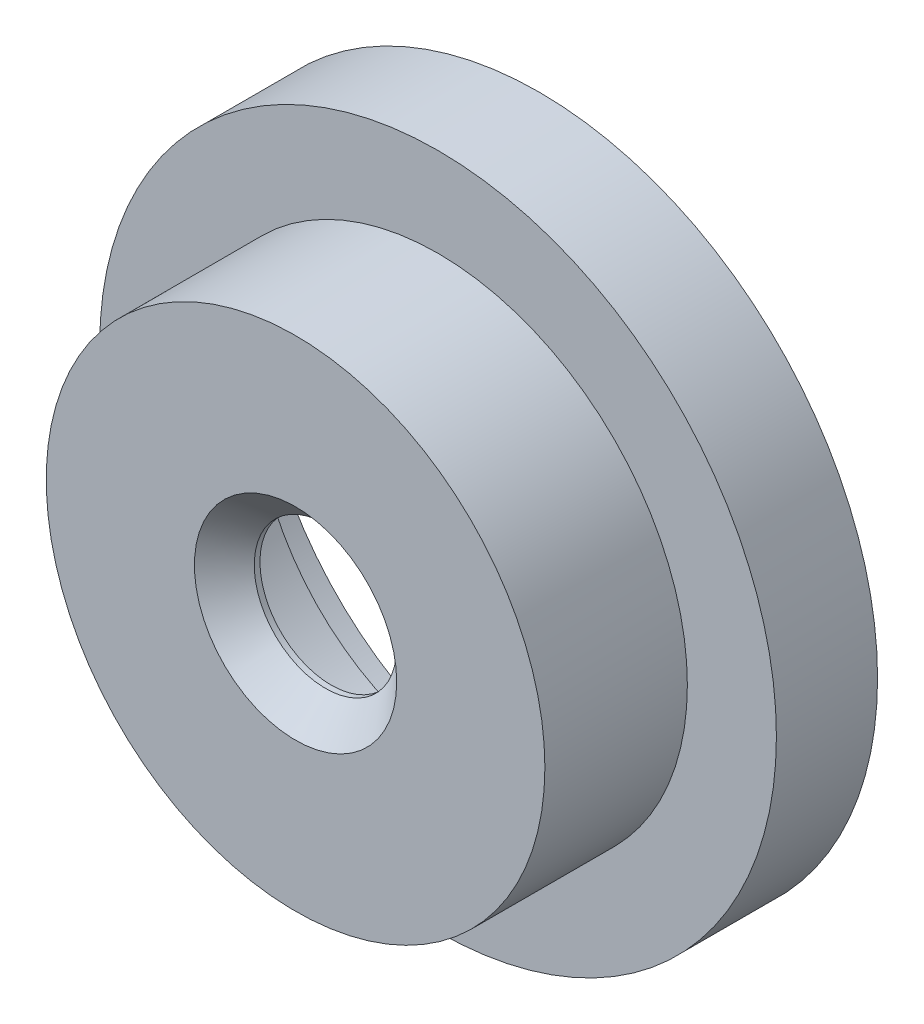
from build123d import *

# Parameters (mm, degrees)
SKETCH1_R                  = 22.225
BOSS_EXTRUDE1_DEPTH        = 12.7
SKETCH2_R                  = 30.1625
BOSS_EXTRUDE2_DEPTH        = 9.017
SKETCH3_R                  = 25.273
CUT_EXTRUDE1_DEPTH         = 5.842
SKETCH4_R                  = 19.431
CUT_EXTRUDE2_DEPTH         = 12.7
F_1_2_0_5_DIAMETER_HOLE1_D = 12.7
CHAMFER1_SIZE              = 2.667
F_4_40_TAPPED_HOLE1_D      = 2.2606
F_4_40_TAPPED_HOLE1_DEPTH  = 6.35
F_4_40_TAPPED_HOLE1_TIP    = 0.679152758


with BuildPart() as part:
    # Sketch1 → Boss-Extrude1 (new body)
    with BuildSketch(Plane.XY):
        Circle(SKETCH1_R)
    extrude(amount=-BOSS_EXTRUDE1_DEPTH)

    # Sketch2 → Boss-Extrude2 (add)
    with BuildSketch(Plane(origin=(0, 0, -12.7), x_dir=(-1, 0, 0), z_dir=(0, 0, -1))):
        Circle(SKETCH2_R)
    extrude(amount=BOSS_EXTRUDE2_DEPTH)

    # Sketch3 → Cut-Extrude1 (cut)
    with BuildSketch(Plane(origin=(0, 0, -21.717), x_dir=(-1, 0, 0), z_dir=(0, 0, -1))):
        Circle(SKETCH3_R)
    extrude(amount=-CUT_EXTRUDE1_DEPTH, mode=Mode.SUBTRACT)

    # Sketch4 → Cut-Extrude2 (cut)
    with BuildSketch(Plane(origin=(0, 0, -15.875), x_dir=(-1, 0, 0), z_dir=(0, 0, -1))):
        Circle(SKETCH4_R)
    extrude(amount=-CUT_EXTRUDE2_DEPTH, mode=Mode.SUBTRACT)

    # 1_2 _0.5_ Diameter Hole1 (through all)
    with Locations(Plane.XY):
        with Locations((0, 0)):
            Hole(F_1_2_0_5_DIAMETER_HOLE1_D / 2)

    # Chamfer1
    chamfer1_edges = [part.edges().sort_by_distance(p)[0] for p in [
        (6.35, 0, 0),
    ]]
    chamfer(chamfer1_edges, length=CHAMFER1_SIZE)

    # 4-40 Tapped Hole1
    with Locations(Plane(origin=(0, 0, -21.717), x_dir=(-1, 0, 0), z_dir=(0, 0, -1))):
        with Locations((0, 27.7114), (27.7114, 0), (0, -27.7114), (-27.7114, 0)):
            Hole(F_4_40_TAPPED_HOLE1_D / 2, depth=F_4_40_TAPPED_HOLE1_DEPTH)
            with Locations((0, 0, -(F_4_40_TAPPED_HOLE1_DEPTH + F_4_40_TAPPED_HOLE1_TIP / 2))):  # 118° drill point
                Cone(0, F_4_40_TAPPED_HOLE1_D / 2, F_4_40_TAPPED_HOLE1_TIP, mode=Mode.SUBTRACT)


solid = part.part
